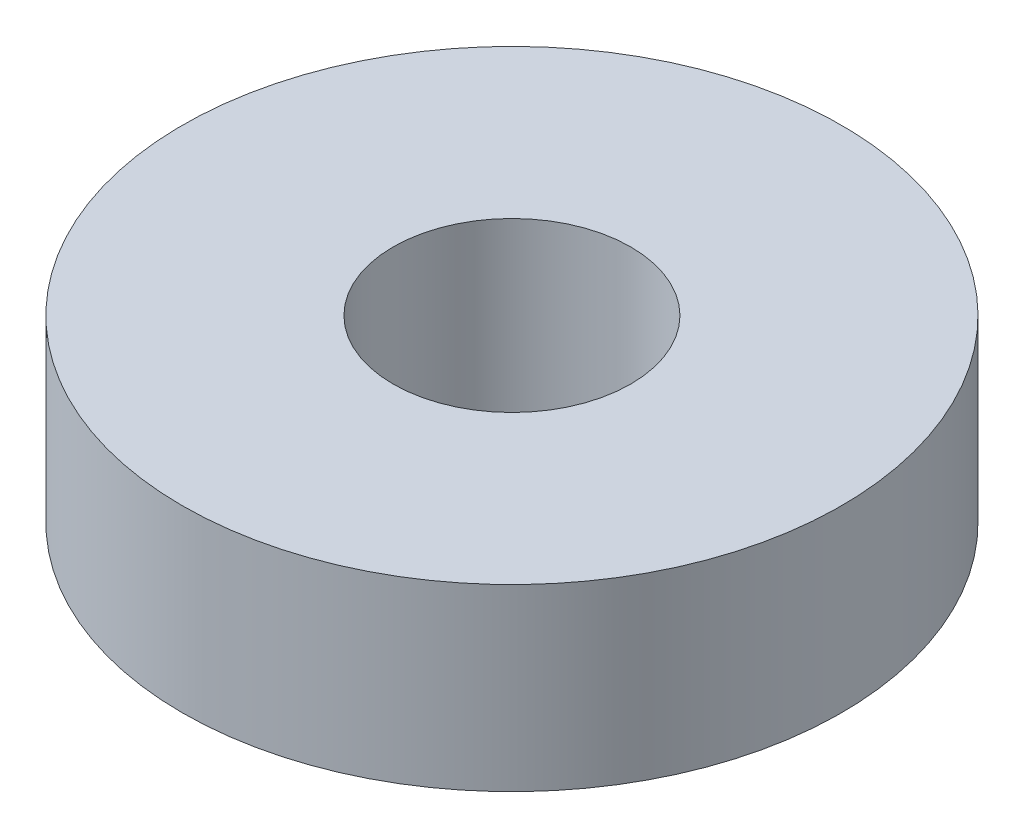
ISO-10303-21;
HEADER;
FILE_DESCRIPTION(('STEP AP214'),'2;1');
FILE_NAME('part.step','',(''),(''),'','','');
FILE_SCHEMA(('AUTOMOTIVE_DESIGN { 1 0 10303 214 1 1 1 1 }'));
ENDSEC;
DATA;
#1=APPLICATION_CONTEXT('core data for automotive mechanical design processes');
#2=APPLICATION_PROTOCOL_DEFINITION('international standard','automotive_design',2000,#1);
#3=PRODUCT_CONTEXT('',#1,'mechanical');
#4=PRODUCT('Part','Part','',(#3));
#5=PRODUCT_RELATED_PRODUCT_CATEGORY('part','',(#4));
#6=PRODUCT_DEFINITION_FORMATION('','',#4);
#7=PRODUCT_DEFINITION_CONTEXT('part definition',#1,'design');
#8=PRODUCT_DEFINITION('design','',#6,#7);
#9=PRODUCT_DEFINITION_SHAPE('','',#8);
#10=(LENGTH_UNIT() NAMED_UNIT(*) SI_UNIT(.MILLI.,.METRE.));
#11=(NAMED_UNIT(*) PLANE_ANGLE_UNIT() SI_UNIT($,.RADIAN.));
#12=(NAMED_UNIT(*) SI_UNIT($,.STERADIAN.) SOLID_ANGLE_UNIT());
#13=UNCERTAINTY_MEASURE_WITH_UNIT(LENGTH_MEASURE(1.E-05),#10,'distance_accuracy_value','');
#14=(GEOMETRIC_REPRESENTATION_CONTEXT(3) GLOBAL_UNCERTAINTY_ASSIGNED_CONTEXT((#13)) GLOBAL_UNIT_ASSIGNED_CONTEXT((#10,
#11,#12)) REPRESENTATION_CONTEXT('',''));
#15=CARTESIAN_POINT('',(0.,0.,0.));
#16=DIRECTION('',(0.,0.,1.));
#17=DIRECTION('',(1.,0.,0.));
#18=AXIS2_PLACEMENT_3D('',#15,#16,#17);
#19=CARTESIAN_POINT('',(0.,5.08,0.));
#20=DIRECTION('',(0.,1.,0.));
#21=DIRECTION('',(0.,0.,1.));
#22=AXIS2_PLACEMENT_3D('',#19,#20,#21);
#23=PLANE('',#22);
#24=CARTESIAN_POINT('',(0.,5.08,0.));
#25=DIRECTION('',(0.,1.,0.));
#26=DIRECTION('',(0.,0.,1.));
#27=AXIS2_PLACEMENT_3D('',#24,#25,#26);
#28=CIRCLE('',#27,9.3345);
#29=CARTESIAN_POINT('',(0.,5.08,9.3345));
#30=VERTEX_POINT('',#29);
#31=EDGE_CURVE('E10',#30,#30,#28,.T.);
#32=ORIENTED_EDGE('',*,*,#31,.T.);
#33=EDGE_LOOP('',(#32));
#34=FACE_BOUND('',#33,.T.);
#35=CARTESIAN_POINT('',(0.,5.08,0.));
#36=DIRECTION('',(0.,1.,0.));
#37=DIRECTION('',(0.,0.,1.));
#38=AXIS2_PLACEMENT_3D('',#35,#36,#37);
#39=CIRCLE('',#38,3.3655);
#40=CARTESIAN_POINT('',(0.,5.08,3.3655));
#41=VERTEX_POINT('',#40);
#42=EDGE_CURVE('E42',#41,#41,#39,.T.);
#43=ORIENTED_EDGE('',*,*,#42,.F.);
#44=EDGE_LOOP('',(#43));
#45=FACE_BOUND('',#44,.T.);
#46=ADVANCED_FACE('F31',(#34,#45),#23,.T.);
#47=CARTESIAN_POINT('',(0.,0.,0.));
#48=DIRECTION('',(0.,1.,0.));
#49=DIRECTION('',(0.,0.,1.));
#50=AXIS2_PLACEMENT_3D('',#47,#48,#49);
#51=PLANE('',#50);
#52=CARTESIAN_POINT('',(0.,0.,0.));
#53=DIRECTION('',(0.,1.,0.));
#54=DIRECTION('',(0.,0.,1.));
#55=AXIS2_PLACEMENT_3D('',#52,#53,#54);
#56=CIRCLE('',#55,9.3345);
#57=CARTESIAN_POINT('',(0.,0.,9.3345));
#58=VERTEX_POINT('',#57);
#59=EDGE_CURVE('E35',#58,#58,#56,.T.);
#60=ORIENTED_EDGE('',*,*,#59,.F.);
#61=EDGE_LOOP('',(#60));
#62=FACE_BOUND('',#61,.T.);
#63=CARTESIAN_POINT('',(0.,0.,0.));
#64=DIRECTION('',(0.,1.,0.));
#65=DIRECTION('',(0.,0.,1.));
#66=AXIS2_PLACEMENT_3D('',#63,#64,#65);
#67=CIRCLE('',#66,3.3655);
#68=CARTESIAN_POINT('',(0.,0.,3.3655));
#69=VERTEX_POINT('',#68);
#70=EDGE_CURVE('E44',#69,#69,#67,.T.);
#71=ORIENTED_EDGE('',*,*,#70,.T.);
#72=EDGE_LOOP('',(#71));
#73=FACE_BOUND('',#72,.T.);
#74=ADVANCED_FACE('F54',(#62,#73),#51,.F.);
#75=CARTESIAN_POINT('',(0.,5.08,0.));
#76=DIRECTION('',(0.,-1.,0.));
#77=DIRECTION('',(0.,0.,-1.));
#78=AXIS2_PLACEMENT_3D('',#75,#76,#77);
#79=CYLINDRICAL_SURFACE('',#78,9.3345);
#80=ORIENTED_EDGE('',*,*,#31,.F.);
#81=EDGE_LOOP('',(#80));
#82=FACE_BOUND('',#81,.T.);
#83=ORIENTED_EDGE('',*,*,#59,.T.);
#84=EDGE_LOOP('',(#83));
#85=FACE_BOUND('',#84,.T.);
#86=ADVANCED_FACE('F33',(#82,#85),#79,.T.);
#87=CARTESIAN_POINT('',(0.,5.08,0.));
#88=DIRECTION('',(0.,-1.,0.));
#89=DIRECTION('',(0.,0.,-1.));
#90=AXIS2_PLACEMENT_3D('',#87,#88,#89);
#91=CYLINDRICAL_SURFACE('',#90,3.3655);
#92=ORIENTED_EDGE('',*,*,#42,.T.);
#93=EDGE_LOOP('',(#92));
#94=FACE_BOUND('',#93,.T.);
#95=ORIENTED_EDGE('',*,*,#70,.F.);
#96=EDGE_LOOP('',(#95));
#97=FACE_BOUND('',#96,.T.);
#98=ADVANCED_FACE('F50',(#94,#97),#91,.F.);
#99=CLOSED_SHELL('',(#46,#74,#86,#98));
#100=MANIFOLD_SOLID_BREP('B2',#99);
#101=ADVANCED_BREP_SHAPE_REPRESENTATION('',(#18,#100),#14);
#102=SHAPE_DEFINITION_REPRESENTATION(#9,#101);
ENDSEC;
END-ISO-10303-21;
